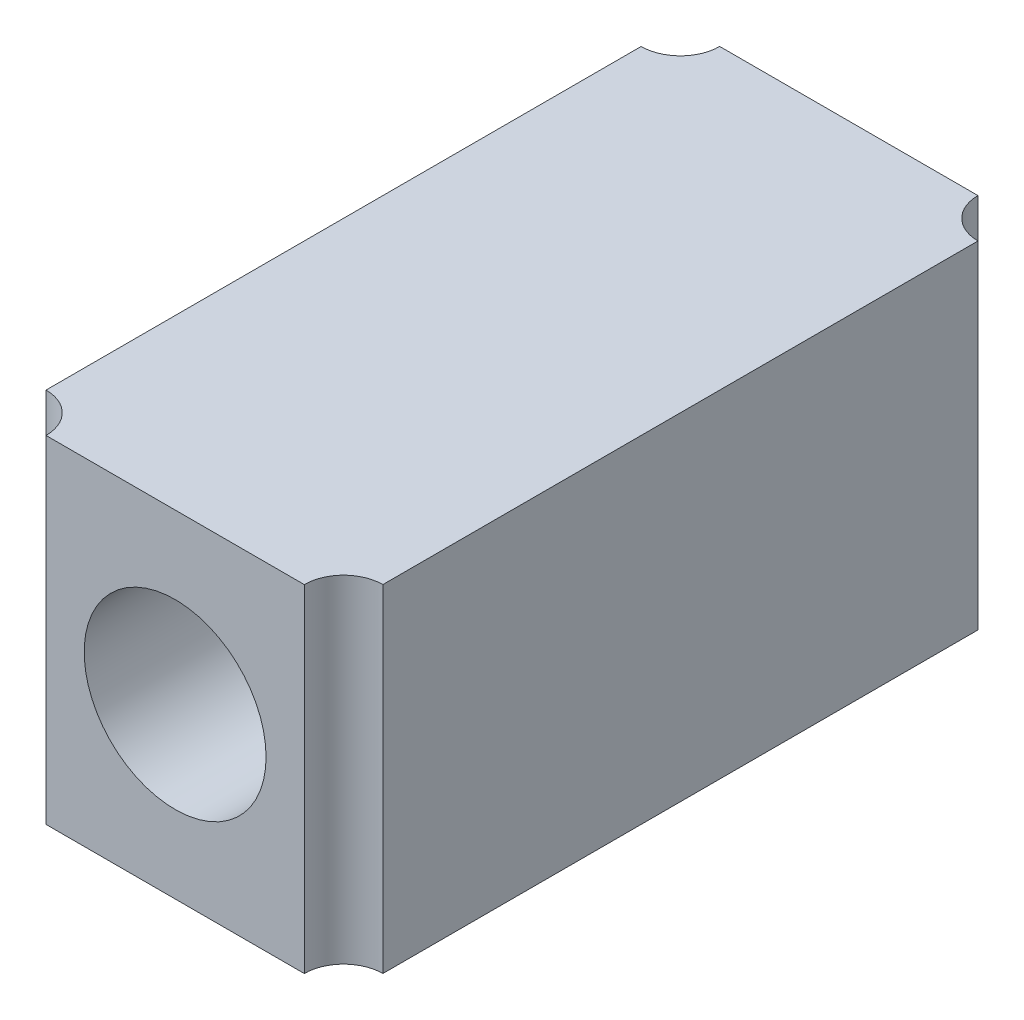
ISO-10303-21;
HEADER;
FILE_DESCRIPTION(('STEP AP214'),'2;1');
FILE_NAME('part.step','',(''),(''),'','','');
FILE_SCHEMA(('AUTOMOTIVE_DESIGN { 1 0 10303 214 1 1 1 1 }'));
ENDSEC;
DATA;
#1=APPLICATION_CONTEXT('core data for automotive mechanical design processes');
#2=APPLICATION_PROTOCOL_DEFINITION('international standard','automotive_design',2000,#1);
#3=PRODUCT_CONTEXT('',#1,'mechanical');
#4=PRODUCT('Part','Part','',(#3));
#5=PRODUCT_RELATED_PRODUCT_CATEGORY('part','',(#4));
#6=PRODUCT_DEFINITION_FORMATION('','',#4);
#7=PRODUCT_DEFINITION_CONTEXT('part definition',#1,'design');
#8=PRODUCT_DEFINITION('design','',#6,#7);
#9=PRODUCT_DEFINITION_SHAPE('','',#8);
#10=(LENGTH_UNIT() NAMED_UNIT(*) SI_UNIT(.MILLI.,.METRE.));
#11=(NAMED_UNIT(*) PLANE_ANGLE_UNIT() SI_UNIT($,.RADIAN.));
#12=(NAMED_UNIT(*) SI_UNIT($,.STERADIAN.) SOLID_ANGLE_UNIT());
#13=UNCERTAINTY_MEASURE_WITH_UNIT(LENGTH_MEASURE(1.E-05),#10,'distance_accuracy_value','');
#14=(GEOMETRIC_REPRESENTATION_CONTEXT(3) GLOBAL_UNCERTAINTY_ASSIGNED_CONTEXT((#13)) GLOBAL_UNIT_ASSIGNED_CONTEXT((#10,
#11,#12)) REPRESENTATION_CONTEXT('',''));
#15=CARTESIAN_POINT('',(0.,0.,0.));
#16=DIRECTION('',(0.,0.,1.));
#17=DIRECTION('',(1.,0.,0.));
#18=AXIS2_PLACEMENT_3D('',#15,#16,#17);
#19=CARTESIAN_POINT('',(0.,0.,30.));
#20=DIRECTION('',(0.,0.,-1.));
#21=DIRECTION('',(-1.,0.,0.));
#22=AXIS2_PLACEMENT_3D('',#19,#20,#21);
#23=PLANE('',#22);
#24=DIRECTION('',(-1.,0.,0.));
#25=VECTOR('',#24,1.);
#26=CARTESIAN_POINT('',(-7.5,7.5,30.));
#27=LINE('',#26,#25);
#28=CARTESIAN_POINT('',(5.75,7.5,30.));
#29=VERTEX_POINT('',#28);
#30=CARTESIAN_POINT('',(-5.75,7.5,30.));
#31=VERTEX_POINT('',#30);
#32=EDGE_CURVE('E113',#29,#31,#27,.T.);
#33=ORIENTED_EDGE('',*,*,#32,.T.);
#34=DIRECTION('',(0.,1.,0.));
#35=VECTOR('',#34,1.);
#36=CARTESIAN_POINT('',(-5.75,-7.5,30.));
#37=LINE('',#36,#35);
#38=CARTESIAN_POINT('',(-5.75,-7.5,30.));
#39=VERTEX_POINT('',#38);
#40=EDGE_CURVE('E99',#31,#39,#37,.F.);
#41=ORIENTED_EDGE('',*,*,#40,.T.);
#42=DIRECTION('',(1.,0.,0.));
#43=VECTOR('',#42,1.);
#44=CARTESIAN_POINT('',(-7.5,-7.5,30.));
#45=LINE('',#44,#43);
#46=CARTESIAN_POINT('',(5.75,-7.5,30.));
#47=VERTEX_POINT('',#46);
#48=EDGE_CURVE('E110',#39,#47,#45,.T.);
#49=ORIENTED_EDGE('',*,*,#48,.T.);
#50=DIRECTION('',(0.,1.,0.));
#51=VECTOR('',#50,1.);
#52=CARTESIAN_POINT('',(5.75,-7.5,30.));
#53=LINE('',#52,#51);
#54=EDGE_CURVE('E162',#47,#29,#53,.T.);
#55=ORIENTED_EDGE('',*,*,#54,.T.);
#56=EDGE_LOOP('',(#33,#41,#49,#55));
#57=FACE_BOUND('',#56,.T.);
#58=CARTESIAN_POINT('',(0.,0.,30.));
#59=DIRECTION('',(0.,0.,1.));
#60=DIRECTION('',(1.,0.,0.));
#61=AXIS2_PLACEMENT_3D('',#58,#59,#60);
#62=CIRCLE('',#61,4.05);
#63=CARTESIAN_POINT('',(4.05,0.,30.));
#64=VERTEX_POINT('',#63);
#65=EDGE_CURVE('E132',#64,#64,#62,.T.);
#66=ORIENTED_EDGE('',*,*,#65,.F.);
#67=EDGE_LOOP('',(#66));
#68=FACE_BOUND('',#67,.T.);
#69=ADVANCED_FACE('F33',(#57,#68),#23,.F.);
#70=CARTESIAN_POINT('',(0.,0.,0.));
#71=DIRECTION('',(0.,0.,-1.));
#72=DIRECTION('',(-1.,0.,0.));
#73=AXIS2_PLACEMENT_3D('',#70,#71,#72);
#74=PLANE('',#73);
#75=DIRECTION('',(0.,1.,0.));
#76=VECTOR('',#75,1.);
#77=CARTESIAN_POINT('',(-5.75,-7.5,0.));
#78=LINE('',#77,#76);
#79=CARTESIAN_POINT('',(-5.75,7.5,0.));
#80=VERTEX_POINT('',#79);
#81=CARTESIAN_POINT('',(-5.75,-7.5,0.));
#82=VERTEX_POINT('',#81);
#83=EDGE_CURVE('E56',#80,#82,#78,.F.);
#84=ORIENTED_EDGE('',*,*,#83,.F.);
#85=DIRECTION('',(-1.,0.,0.));
#86=VECTOR('',#85,1.);
#87=CARTESIAN_POINT('',(-7.5,7.5,0.));
#88=LINE('',#87,#86);
#89=CARTESIAN_POINT('',(5.75,7.5,0.));
#90=VERTEX_POINT('',#89);
#91=EDGE_CURVE('E129',#90,#80,#88,.T.);
#92=ORIENTED_EDGE('',*,*,#91,.F.);
#93=DIRECTION('',(0.,1.,0.));
#94=VECTOR('',#93,1.);
#95=CARTESIAN_POINT('',(5.75,-7.5,0.));
#96=LINE('',#95,#94);
#97=CARTESIAN_POINT('',(5.75,-7.5,0.));
#98=VERTEX_POINT('',#97);
#99=EDGE_CURVE('E153',#98,#90,#96,.T.);
#100=ORIENTED_EDGE('',*,*,#99,.F.);
#101=DIRECTION('',(1.,0.,0.));
#102=VECTOR('',#101,1.);
#103=CARTESIAN_POINT('',(-7.5,-7.5,0.));
#104=LINE('',#103,#102);
#105=EDGE_CURVE('E125',#82,#98,#104,.T.);
#106=ORIENTED_EDGE('',*,*,#105,.F.);
#107=EDGE_LOOP('',(#84,#92,#100,#106));
#108=FACE_BOUND('',#107,.T.);
#109=CARTESIAN_POINT('',(0.,0.,0.));
#110=DIRECTION('',(0.,0.,1.));
#111=DIRECTION('',(1.,0.,0.));
#112=AXIS2_PLACEMENT_3D('',#109,#110,#111);
#113=CIRCLE('',#112,4.05);
#114=CARTESIAN_POINT('',(4.05,0.,0.));
#115=VERTEX_POINT('',#114);
#116=EDGE_CURVE('E164',#115,#115,#113,.T.);
#117=ORIENTED_EDGE('',*,*,#116,.T.);
#118=EDGE_LOOP('',(#117));
#119=FACE_BOUND('',#118,.T.);
#120=ADVANCED_FACE('F169',(#108,#119),#74,.T.);
#121=CARTESIAN_POINT('',(7.5,-7.5,30.));
#122=DIRECTION('',(-1.,0.,0.));
#123=DIRECTION('',(0.,0.,1.));
#124=AXIS2_PLACEMENT_3D('',#121,#122,#123);
#125=PLANE('',#124);
#126=DIRECTION('',(0.,0.,-1.));
#127=VECTOR('',#126,1.);
#128=CARTESIAN_POINT('',(7.5,-7.5,30.));
#129=LINE('',#128,#127);
#130=CARTESIAN_POINT('',(7.5,-7.5,28.25));
#131=VERTEX_POINT('',#130);
#132=CARTESIAN_POINT('',(7.5,-7.5,1.75));
#133=VERTEX_POINT('',#132);
#134=EDGE_CURVE('E120',#131,#133,#129,.T.);
#135=ORIENTED_EDGE('',*,*,#134,.T.);
#136=DIRECTION('',(0.,1.,0.));
#137=VECTOR('',#136,1.);
#138=CARTESIAN_POINT('',(7.5,-7.5,1.75));
#139=LINE('',#138,#137);
#140=CARTESIAN_POINT('',(7.5,7.5,1.75));
#141=VERTEX_POINT('',#140);
#142=EDGE_CURVE('E150',#133,#141,#139,.T.);
#143=ORIENTED_EDGE('',*,*,#142,.T.);
#144=DIRECTION('',(0.,0.,-1.));
#145=VECTOR('',#144,1.);
#146=CARTESIAN_POINT('',(7.5,7.5,30.));
#147=LINE('',#146,#145);
#148=CARTESIAN_POINT('',(7.5,7.5,28.25));
#149=VERTEX_POINT('',#148);
#150=EDGE_CURVE('E41',#149,#141,#147,.T.);
#151=ORIENTED_EDGE('',*,*,#150,.F.);
#152=DIRECTION('',(0.,1.,0.));
#153=VECTOR('',#152,1.);
#154=CARTESIAN_POINT('',(7.5,-7.5,28.25));
#155=LINE('',#154,#153);
#156=EDGE_CURVE('E149',#149,#131,#155,.F.);
#157=ORIENTED_EDGE('',*,*,#156,.T.);
#158=EDGE_LOOP('',(#135,#143,#151,#157));
#159=FACE_BOUND('',#158,.T.);
#160=ADVANCED_FACE('F35',(#159),#125,.F.);
#161=CARTESIAN_POINT('',(-7.5,7.5,30.));
#162=DIRECTION('',(0.,-1.,0.));
#163=DIRECTION('',(0.,0.,-1.));
#164=AXIS2_PLACEMENT_3D('',#161,#162,#163);
#165=PLANE('',#164);
#166=DIRECTION('',(0.,0.,-1.));
#167=VECTOR('',#166,1.);
#168=CARTESIAN_POINT('',(-7.5,7.5,30.));
#169=LINE('',#168,#167);
#170=CARTESIAN_POINT('',(-7.5,7.5,28.25));
#171=VERTEX_POINT('',#170);
#172=CARTESIAN_POINT('',(-7.5,7.5,1.75));
#173=VERTEX_POINT('',#172);
#174=EDGE_CURVE('E135',#171,#173,#169,.T.);
#175=ORIENTED_EDGE('',*,*,#174,.F.);
#176=CARTESIAN_POINT('',(-7.5,7.5,30.));
#177=DIRECTION('',(0.,1.,0.));
#178=DIRECTION('',(0.,0.,1.));
#179=AXIS2_PLACEMENT_3D('',#176,#177,#178);
#180=CIRCLE('',#179,1.75);
#181=EDGE_CURVE('E104',#31,#171,#180,.T.);
#182=ORIENTED_EDGE('',*,*,#181,.F.);
#183=ORIENTED_EDGE('',*,*,#32,.F.);
#184=CARTESIAN_POINT('',(7.5,7.5,30.));
#185=DIRECTION('',(0.,1.,0.));
#186=DIRECTION('',(0.,0.,1.));
#187=AXIS2_PLACEMENT_3D('',#184,#185,#186);
#188=CIRCLE('',#187,1.75);
#189=EDGE_CURVE('E145',#149,#29,#188,.T.);
#190=ORIENTED_EDGE('',*,*,#189,.F.);
#191=ORIENTED_EDGE('',*,*,#150,.T.);
#192=CARTESIAN_POINT('',(7.5,7.5,0.));
#193=DIRECTION('',(0.,1.,0.));
#194=DIRECTION('',(0.,0.,1.));
#195=AXIS2_PLACEMENT_3D('',#192,#193,#194);
#196=CIRCLE('',#195,1.75);
#197=EDGE_CURVE('E143',#90,#141,#196,.T.);
#198=ORIENTED_EDGE('',*,*,#197,.F.);
#199=ORIENTED_EDGE('',*,*,#91,.T.);
#200=CARTESIAN_POINT('',(-7.5,7.5,0.));
#201=DIRECTION('',(0.,1.,0.));
#202=DIRECTION('',(0.,0.,1.));
#203=AXIS2_PLACEMENT_3D('',#200,#201,#202);
#204=CIRCLE('',#203,1.75);
#205=EDGE_CURVE('E114',#173,#80,#204,.T.);
#206=ORIENTED_EDGE('',*,*,#205,.F.);
#207=EDGE_LOOP('',(#175,#182,#183,#190,#191,#198,#199,#206));
#208=FACE_BOUND('',#207,.T.);
#209=ADVANCED_FACE('F142',(#208),#165,.F.);
#210=CARTESIAN_POINT('',(-7.5,-7.5,30.));
#211=DIRECTION('',(1.,0.,0.));
#212=DIRECTION('',(0.,0.,-1.));
#213=AXIS2_PLACEMENT_3D('',#210,#211,#212);
#214=PLANE('',#213);
#215=DIRECTION('',(0.,0.,-1.));
#216=VECTOR('',#215,1.);
#217=CARTESIAN_POINT('',(-7.5,-7.5,30.));
#218=LINE('',#217,#216);
#219=CARTESIAN_POINT('',(-7.5,-7.5,28.25));
#220=VERTEX_POINT('',#219);
#221=CARTESIAN_POINT('',(-7.5,-7.5,1.75));
#222=VERTEX_POINT('',#221);
#223=EDGE_CURVE('E123',#220,#222,#218,.T.);
#224=ORIENTED_EDGE('',*,*,#223,.F.);
#225=DIRECTION('',(0.,1.,0.));
#226=VECTOR('',#225,1.);
#227=CARTESIAN_POINT('',(-7.5,-7.5,28.25));
#228=LINE('',#227,#226);
#229=EDGE_CURVE('E48',#220,#171,#228,.T.);
#230=ORIENTED_EDGE('',*,*,#229,.T.);
#231=ORIENTED_EDGE('',*,*,#174,.T.);
#232=DIRECTION('',(0.,1.,0.));
#233=VECTOR('',#232,1.);
#234=CARTESIAN_POINT('',(-7.5,-7.5,1.75));
#235=LINE('',#234,#233);
#236=EDGE_CURVE('E259',#173,#222,#235,.F.);
#237=ORIENTED_EDGE('',*,*,#236,.T.);
#238=EDGE_LOOP('',(#224,#230,#231,#237));
#239=FACE_BOUND('',#238,.T.);
#240=ADVANCED_FACE('F183',(#239),#214,.F.);
#241=CARTESIAN_POINT('',(-7.5,-7.5,30.));
#242=DIRECTION('',(0.,1.,0.));
#243=DIRECTION('',(0.,0.,1.));
#244=AXIS2_PLACEMENT_3D('',#241,#242,#243);
#245=PLANE('',#244);
#246=ORIENTED_EDGE('',*,*,#48,.F.);
#247=CARTESIAN_POINT('',(-7.5,-7.5,30.));
#248=DIRECTION('',(0.,1.,0.));
#249=DIRECTION('',(0.,0.,1.));
#250=AXIS2_PLACEMENT_3D('',#247,#248,#249);
#251=CIRCLE('',#250,1.75);
#252=EDGE_CURVE('E96',#39,#220,#251,.T.);
#253=ORIENTED_EDGE('',*,*,#252,.T.);
#254=ORIENTED_EDGE('',*,*,#223,.T.);
#255=CARTESIAN_POINT('',(-7.5,-7.5,0.));
#256=DIRECTION('',(0.,1.,0.));
#257=DIRECTION('',(0.,0.,1.));
#258=AXIS2_PLACEMENT_3D('',#255,#256,#257);
#259=CIRCLE('',#258,1.75);
#260=EDGE_CURVE('E257',#222,#82,#259,.T.);
#261=ORIENTED_EDGE('',*,*,#260,.T.);
#262=ORIENTED_EDGE('',*,*,#105,.T.);
#263=CARTESIAN_POINT('',(7.5,-7.5,0.));
#264=DIRECTION('',(0.,1.,0.));
#265=DIRECTION('',(0.,0.,1.));
#266=AXIS2_PLACEMENT_3D('',#263,#264,#265);
#267=CIRCLE('',#266,1.75);
#268=EDGE_CURVE('E11',#98,#133,#267,.T.);
#269=ORIENTED_EDGE('',*,*,#268,.T.);
#270=ORIENTED_EDGE('',*,*,#134,.F.);
#271=CARTESIAN_POINT('',(7.5,-7.5,30.));
#272=DIRECTION('',(0.,1.,0.));
#273=DIRECTION('',(0.,0.,1.));
#274=AXIS2_PLACEMENT_3D('',#271,#272,#273);
#275=CIRCLE('',#274,1.75);
#276=EDGE_CURVE('E119',#131,#47,#275,.T.);
#277=ORIENTED_EDGE('',*,*,#276,.T.);
#278=EDGE_LOOP('',(#246,#253,#254,#261,#262,#269,#270,#277));
#279=FACE_BOUND('',#278,.T.);
#280=ADVANCED_FACE('F117',(#279),#245,.F.);
#281=CARTESIAN_POINT('',(0.,0.,30.));
#282=DIRECTION('',(0.,0.,-1.));
#283=DIRECTION('',(-1.,0.,0.));
#284=AXIS2_PLACEMENT_3D('',#281,#282,#283);
#285=CYLINDRICAL_SURFACE('',#284,4.05);
#286=ORIENTED_EDGE('',*,*,#65,.T.);
#287=EDGE_LOOP('',(#286));
#288=FACE_BOUND('',#287,.T.);
#289=ORIENTED_EDGE('',*,*,#116,.F.);
#290=EDGE_LOOP('',(#289));
#291=FACE_BOUND('',#290,.T.);
#292=ADVANCED_FACE('F171',(#288,#291),#285,.F.);
#293=CARTESIAN_POINT('',(7.5,-7.5,30.));
#294=DIRECTION('',(0.,1.,0.));
#295=DIRECTION('',(0.,0.,1.));
#296=AXIS2_PLACEMENT_3D('',#293,#294,#295);
#297=CYLINDRICAL_SURFACE('',#296,1.75);
#298=ORIENTED_EDGE('',*,*,#276,.F.);
#299=ORIENTED_EDGE('',*,*,#156,.F.);
#300=ORIENTED_EDGE('',*,*,#189,.T.);
#301=ORIENTED_EDGE('',*,*,#54,.F.);
#302=EDGE_LOOP('',(#298,#299,#300,#301));
#303=FACE_BOUND('',#302,.T.);
#304=ADVANCED_FACE('F173',(#303),#297,.F.);
#305=CARTESIAN_POINT('',(7.5,-7.5,0.));
#306=DIRECTION('',(0.,1.,0.));
#307=DIRECTION('',(0.,0.,1.));
#308=AXIS2_PLACEMENT_3D('',#305,#306,#307);
#309=CYLINDRICAL_SURFACE('',#308,1.75);
#310=ORIENTED_EDGE('',*,*,#99,.T.);
#311=ORIENTED_EDGE('',*,*,#197,.T.);
#312=ORIENTED_EDGE('',*,*,#142,.F.);
#313=ORIENTED_EDGE('',*,*,#268,.F.);
#314=EDGE_LOOP('',(#310,#311,#312,#313));
#315=FACE_BOUND('',#314,.T.);
#316=ADVANCED_FACE('F180',(#315),#309,.F.);
#317=CARTESIAN_POINT('',(-7.5,-7.5,0.));
#318=DIRECTION('',(0.,1.,0.));
#319=DIRECTION('',(0.,0.,1.));
#320=AXIS2_PLACEMENT_3D('',#317,#318,#319);
#321=CYLINDRICAL_SURFACE('',#320,1.75);
#322=ORIENTED_EDGE('',*,*,#83,.T.);
#323=ORIENTED_EDGE('',*,*,#260,.F.);
#324=ORIENTED_EDGE('',*,*,#236,.F.);
#325=ORIENTED_EDGE('',*,*,#205,.T.);
#326=EDGE_LOOP('',(#322,#323,#324,#325));
#327=FACE_BOUND('',#326,.T.);
#328=ADVANCED_FACE('F233',(#327),#321,.F.);
#329=CARTESIAN_POINT('',(-7.5,-7.5,30.));
#330=DIRECTION('',(0.,1.,0.));
#331=DIRECTION('',(0.,0.,1.));
#332=AXIS2_PLACEMENT_3D('',#329,#330,#331);
#333=CYLINDRICAL_SURFACE('',#332,1.75);
#334=ORIENTED_EDGE('',*,*,#181,.T.);
#335=ORIENTED_EDGE('',*,*,#229,.F.);
#336=ORIENTED_EDGE('',*,*,#252,.F.);
#337=ORIENTED_EDGE('',*,*,#40,.F.);
#338=EDGE_LOOP('',(#334,#335,#336,#337));
#339=FACE_BOUND('',#338,.T.);
#340=ADVANCED_FACE('F98',(#339),#333,.F.);
#341=CLOSED_SHELL('',(#69,#120,#160,#209,#240,#280,#292,#304,#316,#328,#340));
#342=MANIFOLD_SOLID_BREP('B2',#341);
#343=ADVANCED_BREP_SHAPE_REPRESENTATION('',(#18,#342),#14);
#344=SHAPE_DEFINITION_REPRESENTATION(#9,#343);
ENDSEC;
END-ISO-10303-21;
